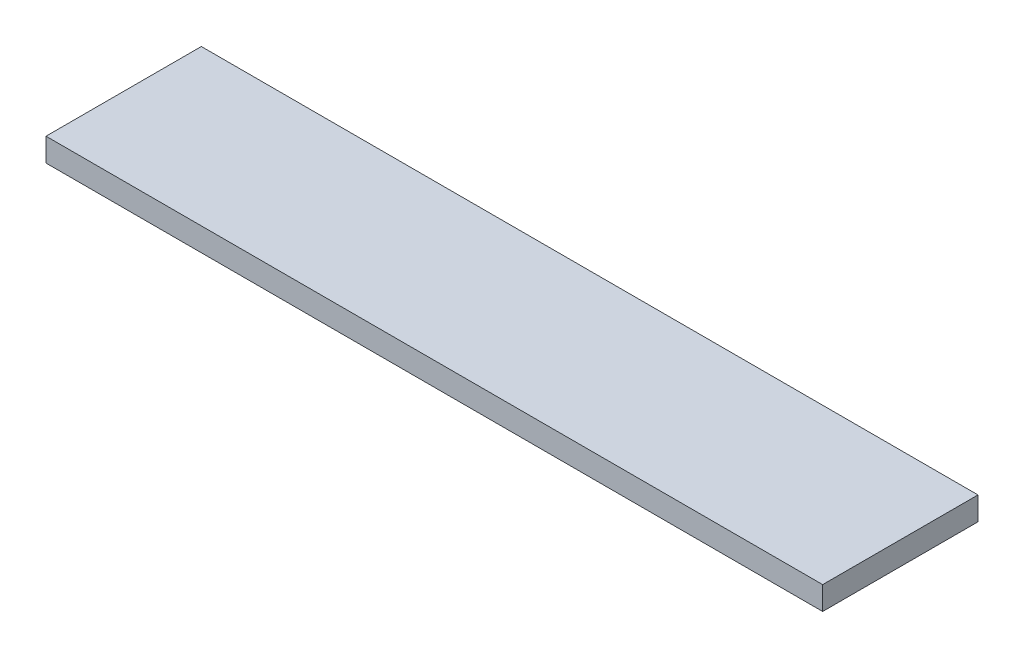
from build123d import *

# Parameters (mm, degrees)
SKETCH1_W           = 1000
SKETCH1_H           = 30
BOSS_EXTRUDE1_DEPTH = 100


with BuildPart() as part:
    # Sketch1 → Boss-Extrude1 (new, symmetric)
    with BuildSketch(Plane.XY):
        with Locations((500, 0)):
            Rectangle(SKETCH1_W, SKETCH1_H)
    extrude(amount=BOSS_EXTRUDE1_DEPTH, both=True)


solid = part.part
